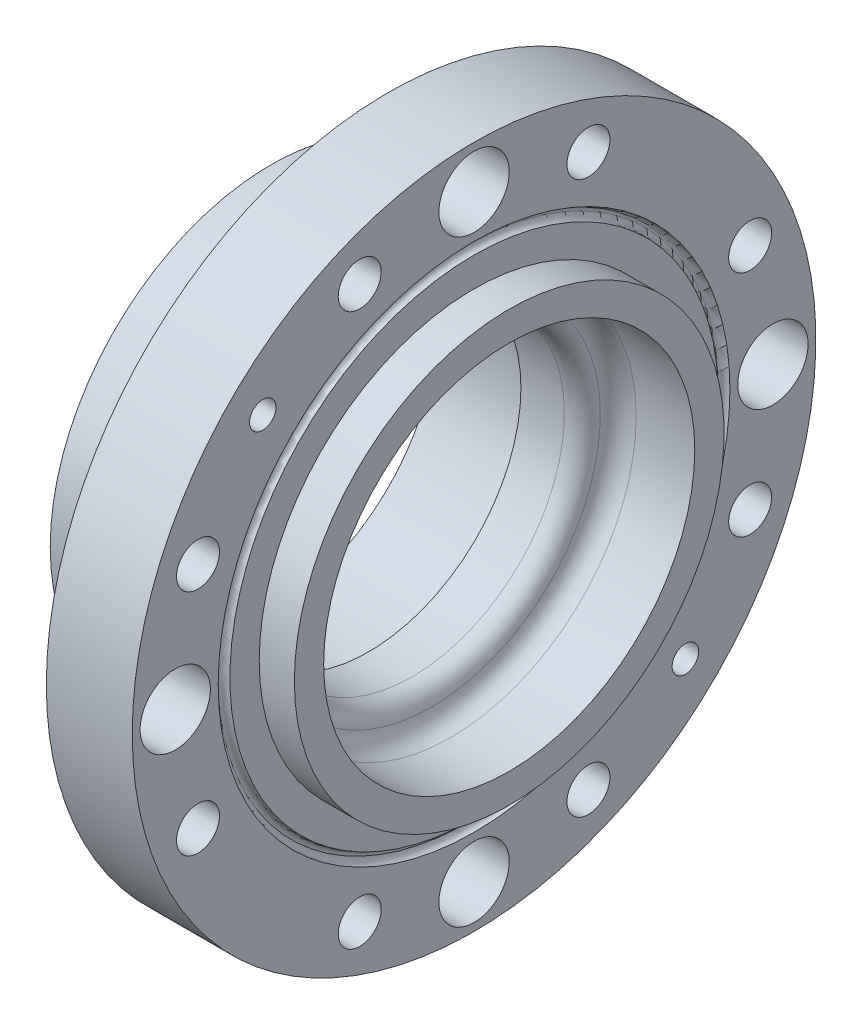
ISO-10303-21;
HEADER;
FILE_DESCRIPTION(('STEP AP214'),'2;1');
FILE_NAME('part.step','',(''),(''),'','','');
FILE_SCHEMA(('AUTOMOTIVE_DESIGN { 1 0 10303 214 1 1 1 1 }'));
ENDSEC;
DATA;
#1=APPLICATION_CONTEXT('core data for automotive mechanical design processes');
#2=APPLICATION_PROTOCOL_DEFINITION('international standard','automotive_design',2000,#1);
#3=PRODUCT_CONTEXT('',#1,'mechanical');
#4=PRODUCT('Part','Part','',(#3));
#5=PRODUCT_RELATED_PRODUCT_CATEGORY('part','',(#4));
#6=PRODUCT_DEFINITION_FORMATION('','',#4);
#7=PRODUCT_DEFINITION_CONTEXT('part definition',#1,'design');
#8=PRODUCT_DEFINITION('design','',#6,#7);
#9=PRODUCT_DEFINITION_SHAPE('','',#8);
#10=(LENGTH_UNIT() NAMED_UNIT(*) SI_UNIT(.MILLI.,.METRE.));
#11=(NAMED_UNIT(*) PLANE_ANGLE_UNIT() SI_UNIT($,.RADIAN.));
#12=(NAMED_UNIT(*) SI_UNIT($,.STERADIAN.) SOLID_ANGLE_UNIT());
#13=UNCERTAINTY_MEASURE_WITH_UNIT(LENGTH_MEASURE(1.E-05),#10,'distance_accuracy_value','');
#14=(GEOMETRIC_REPRESENTATION_CONTEXT(3) GLOBAL_UNCERTAINTY_ASSIGNED_CONTEXT((#13)) GLOBAL_UNIT_ASSIGNED_CONTEXT((#10,
#11,#12)) REPRESENTATION_CONTEXT('',''));
#15=CARTESIAN_POINT('',(0.,0.,0.));
#16=DIRECTION('',(0.,0.,1.));
#17=DIRECTION('',(1.,0.,0.));
#18=AXIS2_PLACEMENT_3D('',#15,#16,#17);
#19=CARTESIAN_POINT('',(5.,0.,0.));
#20=DIRECTION('',(-1.,0.,0.));
#21=DIRECTION('',(0.,0.,1.));
#22=AXIS2_PLACEMENT_3D('',#19,#20,#21);
#23=CYLINDRICAL_SURFACE('',#22,39.);
#24=CARTESIAN_POINT('',(36.1129536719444,0.,0.));
#25=DIRECTION('',(-1.,0.,0.));
#26=DIRECTION('',(0.,-1.,0.));
#27=AXIS2_PLACEMENT_3D('',#24,#25,#26);
#28=CIRCLE('',#27,39.);
#29=CARTESIAN_POINT('',(36.1129536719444,-39.,0.));
#30=VERTEX_POINT('',#29);
#31=EDGE_CURVE('E47',#30,#30,#28,.F.);
#32=ORIENTED_EDGE('',*,*,#31,.T.);
#33=EDGE_LOOP('',(#32));
#34=FACE_BOUND('',#33,.T.);
#35=CARTESIAN_POINT('',(25.,0.,0.));
#36=DIRECTION('',(-1.,0.,0.));
#37=DIRECTION('',(0.,0.,1.));
#38=AXIS2_PLACEMENT_3D('',#35,#36,#37);
#39=CIRCLE('',#38,39.);
#40=CARTESIAN_POINT('',(25.,0.,39.));
#41=VERTEX_POINT('',#40);
#42=EDGE_CURVE('E253',#41,#41,#39,.F.);
#43=ORIENTED_EDGE('',*,*,#42,.F.);
#44=EDGE_LOOP('',(#43));
#45=FACE_BOUND('',#44,.T.);
#46=ADVANCED_FACE('F39',(#34,#45),#23,.F.);
#47=CARTESIAN_POINT('',(51.999813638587,-39.3565741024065,0.));
#48=DIRECTION('',(1.,0.,0.));
#49=DIRECTION('',(0.,0.,-1.));
#50=AXIS2_PLACEMENT_3D('',#47,#48,#49);
#51=PLANE('',#50);
#52=CARTESIAN_POINT('',(51.999813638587,0.,0.));
#53=DIRECTION('',(-1.,0.,0.));
#54=DIRECTION('',(0.,0.,1.));
#55=AXIS2_PLACEMENT_3D('',#52,#53,#54);
#56=CIRCLE('',#55,55.);
#57=CARTESIAN_POINT('',(51.999813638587,0.,55.));
#58=VERTEX_POINT('',#57);
#59=EDGE_CURVE('E236',#58,#58,#56,.T.);
#60=ORIENTED_EDGE('',*,*,#59,.T.);
#61=EDGE_LOOP('',(#60));
#62=FACE_BOUND('',#61,.T.);
#63=CARTESIAN_POINT('',(51.999813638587,0.,0.));
#64=DIRECTION('',(1.,0.,0.));
#65=DIRECTION('',(0.,1.,0.));
#66=AXIS2_PLACEMENT_3D('',#63,#64,#65);
#67=CIRCLE('',#66,62.5);
#68=CARTESIAN_POINT('',(51.999813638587,62.5,0.));
#69=VERTEX_POINT('',#68);
#70=EDGE_CURVE('E252',#69,#69,#67,.T.);
#71=ORIENTED_EDGE('',*,*,#70,.T.);
#72=EDGE_LOOP('',(#71));
#73=FACE_BOUND('',#72,.T.);
#74=ADVANCED_FACE('F273',(#62,#73),#51,.T.);
#75=CARTESIAN_POINT('',(22.0003945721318,0.,0.));
#76=DIRECTION('',(-1.,0.,0.));
#77=DIRECTION('',(0.,0.,1.));
#78=AXIS2_PLACEMENT_3D('',#75,#76,#77);
#79=TOROIDAL_SURFACE('',#78,64.5001456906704,8.00000000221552);
#80=CARTESIAN_POINT('',(30.0003945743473,0.,0.));
#81=DIRECTION('',(-1.,0.,0.));
#82=DIRECTION('',(0.,0.,1.));
#83=AXIS2_PLACEMENT_3D('',#80,#81,#82);
#84=CIRCLE('',#83,64.5001456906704);
#85=CARTESIAN_POINT('',(30.0003945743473,0.,64.5001456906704));
#86=VERTEX_POINT('',#85);
#87=EDGE_CURVE('E227',#86,#86,#84,.T.);
#88=ORIENTED_EDGE('',*,*,#87,.T.);
#89=EDGE_LOOP('',(#88));
#90=FACE_BOUND('',#89,.T.);
#91=CARTESIAN_POINT('',(22.0001938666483,0.,0.));
#92=DIRECTION('',(-1.,0.,0.));
#93=DIRECTION('',(0.,0.,1.));
#94=AXIS2_PLACEMENT_3D('',#91,#92,#93);
#95=CIRCLE('',#94,56.5001456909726);
#96=CARTESIAN_POINT('',(22.0001938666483,0.,56.5001456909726));
#97=VERTEX_POINT('',#96);
#98=EDGE_CURVE('E245',#97,#97,#95,.T.);
#99=ORIENTED_EDGE('',*,*,#98,.F.);
#100=EDGE_LOOP('',(#99));
#101=FACE_BOUND('',#100,.T.);
#102=ADVANCED_FACE('F278',(#90,#101),#79,.F.);
#103=CARTESIAN_POINT('',(0.,0.,0.));
#104=DIRECTION('',(-1.,0.,0.));
#105=DIRECTION('',(0.,0.,1.));
#106=AXIS2_PLACEMENT_3D('',#103,#104,#105);
#107=CYLINDRICAL_SURFACE('',#106,56.5001456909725);
#108=CARTESIAN_POINT('',(0.,0.,0.));
#109=DIRECTION('',(-1.,0.,0.));
#110=DIRECTION('',(0.,0.,1.));
#111=AXIS2_PLACEMENT_3D('',#108,#109,#110);
#112=CIRCLE('',#111,56.5001456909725);
#113=CARTESIAN_POINT('',(0.,0.,56.5001456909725));
#114=VERTEX_POINT('',#113);
#115=EDGE_CURVE('E242',#114,#114,#112,.T.);
#116=ORIENTED_EDGE('',*,*,#115,.F.);
#117=EDGE_LOOP('',(#116));
#118=FACE_BOUND('',#117,.T.);
#119=ORIENTED_EDGE('',*,*,#98,.T.);
#120=EDGE_LOOP('',(#119));
#121=FACE_BOUND('',#120,.T.);
#122=ADVANCED_FACE('F434',(#118,#121),#107,.T.);
#123=CARTESIAN_POINT('',(0.,-39.3565741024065,0.));
#124=DIRECTION('',(1.,0.,0.));
#125=DIRECTION('',(0.,0.,-1.));
#126=AXIS2_PLACEMENT_3D('',#123,#124,#125);
#127=PLANE('',#126);
#128=CARTESIAN_POINT('',(0.,0.,0.));
#129=DIRECTION('',(-1.,0.,0.));
#130=DIRECTION('',(0.,0.,1.));
#131=AXIS2_PLACEMENT_3D('',#128,#129,#130);
#132=CIRCLE('',#131,42.5);
#133=CARTESIAN_POINT('',(0.,0.,42.5));
#134=VERTEX_POINT('',#133);
#135=EDGE_CURVE('E466',#134,#134,#132,.T.);
#136=ORIENTED_EDGE('',*,*,#135,.F.);
#137=EDGE_LOOP('',(#136));
#138=FACE_BOUND('',#137,.T.);
#139=CARTESIAN_POINT('',(0.,34.294678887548,34.2946788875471));
#140=DIRECTION('',(-1.,0.,0.));
#141=DIRECTION('',(0.,0.,1.));
#142=AXIS2_PLACEMENT_3D('',#139,#140,#141);
#143=CIRCLE('',#142,2.49999999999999);
#144=CARTESIAN_POINT('',(0.,34.294678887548,36.7946788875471));
#145=VERTEX_POINT('',#144);
#146=EDGE_CURVE('E83',#145,#145,#143,.T.);
#147=ORIENTED_EDGE('',*,*,#146,.F.);
#148=EDGE_LOOP('',(#147));
#149=FACE_BOUND('',#148,.T.);
#150=CARTESIAN_POINT('',(0.,5.08010534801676E-13,48.5));
#151=DIRECTION('',(-1.,0.,0.));
#152=DIRECTION('',(0.,0.,1.));
#153=AXIS2_PLACEMENT_3D('',#150,#151,#152);
#154=CIRCLE('',#153,2.49999999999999);
#155=CARTESIAN_POINT('',(0.,5.08010534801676E-13,51.));
#156=VERTEX_POINT('',#155);
#157=EDGE_CURVE('E82',#156,#156,#154,.T.);
#158=ORIENTED_EDGE('',*,*,#157,.F.);
#159=EDGE_LOOP('',(#158));
#160=FACE_BOUND('',#159,.T.);
#161=CARTESIAN_POINT('',(0.,-34.2946788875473,34.2946788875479));
#162=DIRECTION('',(-1.,0.,0.));
#163=DIRECTION('',(0.,0.,1.));
#164=AXIS2_PLACEMENT_3D('',#161,#162,#163);
#165=CIRCLE('',#164,2.49999999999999);
#166=CARTESIAN_POINT('',(0.,-34.2946788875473,36.7946788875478));
#167=VERTEX_POINT('',#166);
#168=EDGE_CURVE('E95',#167,#167,#165,.T.);
#169=ORIENTED_EDGE('',*,*,#168,.F.);
#170=EDGE_LOOP('',(#169));
#171=FACE_BOUND('',#170,.T.);
#172=CARTESIAN_POINT('',(0.,-48.5,3.38673689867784E-13));
#173=DIRECTION('',(-1.,0.,0.));
#174=DIRECTION('',(0.,0.,1.));
#175=AXIS2_PLACEMENT_3D('',#172,#173,#174);
#176=CIRCLE('',#175,2.49999999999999);
#177=CARTESIAN_POINT('',(0.,-48.5,2.50000000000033));
#178=VERTEX_POINT('',#177);
#179=EDGE_CURVE('E101',#178,#178,#176,.T.);
#180=ORIENTED_EDGE('',*,*,#179,.F.);
#181=EDGE_LOOP('',(#180));
#182=FACE_BOUND('',#181,.T.);
#183=CARTESIAN_POINT('',(0.,-34.2946788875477,-34.2946788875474));
#184=DIRECTION('',(-1.,0.,0.));
#185=DIRECTION('',(0.,0.,1.));
#186=AXIS2_PLACEMENT_3D('',#183,#184,#185);
#187=CIRCLE('',#186,2.49999999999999);
#188=CARTESIAN_POINT('',(0.,-34.2946788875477,-31.7946788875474));
#189=VERTEX_POINT('',#188);
#190=EDGE_CURVE('E107',#189,#189,#187,.T.);
#191=ORIENTED_EDGE('',*,*,#190,.F.);
#192=EDGE_LOOP('',(#191));
#193=FACE_BOUND('',#192,.T.);
#194=CARTESIAN_POINT('',(0.,-1.69336844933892E-13,-48.5));
#195=DIRECTION('',(-1.,0.,0.));
#196=DIRECTION('',(0.,0.,1.));
#197=AXIS2_PLACEMENT_3D('',#194,#195,#196);
#198=CIRCLE('',#197,2.49999999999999);
#199=CARTESIAN_POINT('',(0.,-1.69336844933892E-13,-46.));
#200=VERTEX_POINT('',#199);
#201=EDGE_CURVE('E113',#200,#200,#198,.T.);
#202=ORIENTED_EDGE('',*,*,#201,.F.);
#203=EDGE_LOOP('',(#202));
#204=FACE_BOUND('',#203,.T.);
#205=CARTESIAN_POINT('',(0.,34.2946788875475,-34.2946788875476));
#206=DIRECTION('',(-1.,0.,0.));
#207=DIRECTION('',(0.,0.,1.));
#208=AXIS2_PLACEMENT_3D('',#205,#206,#207);
#209=CIRCLE('',#208,2.49999999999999);
#210=CARTESIAN_POINT('',(0.,34.2946788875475,-31.7946788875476));
#211=VERTEX_POINT('',#210);
#212=EDGE_CURVE('E119',#211,#211,#209,.T.);
#213=ORIENTED_EDGE('',*,*,#212,.F.);
#214=EDGE_LOOP('',(#213));
#215=FACE_BOUND('',#214,.T.);
#216=CARTESIAN_POINT('',(0.,48.5,0.));
#217=DIRECTION('',(-1.,0.,0.));
#218=DIRECTION('',(0.,0.,1.));
#219=AXIS2_PLACEMENT_3D('',#216,#217,#218);
#220=CIRCLE('',#219,2.49999999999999);
#221=CARTESIAN_POINT('',(0.,48.5,2.49999999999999));
#222=VERTEX_POINT('',#221);
#223=EDGE_CURVE('E125',#222,#222,#220,.T.);
#224=ORIENTED_EDGE('',*,*,#223,.F.);
#225=EDGE_LOOP('',(#224));
#226=FACE_BOUND('',#225,.T.);
#227=ORIENTED_EDGE('',*,*,#115,.T.);
#228=EDGE_LOOP('',(#227));
#229=FACE_BOUND('',#228,.T.);
#230=ADVANCED_FACE('F430',(#138,#149,#160,#171,#182,#193,#204,#215,#226,#229),#127,.F.);
#231=CARTESIAN_POINT('',(60.999813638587,-39.3565741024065,0.));
#232=DIRECTION('',(-1.,0.,0.));
#233=DIRECTION('',(0.,0.,1.));
#234=AXIS2_PLACEMENT_3D('',#231,#232,#233);
#235=PLANE('',#234);
#236=CARTESIAN_POINT('',(60.999813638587,0.,0.));
#237=DIRECTION('',(1.,0.,0.));
#238=DIRECTION('',(0.,1.,0.));
#239=AXIS2_PLACEMENT_3D('',#236,#237,#238);
#240=CIRCLE('',#239,47.5);
#241=CARTESIAN_POINT('',(60.999813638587,47.5,0.));
#242=VERTEX_POINT('',#241);
#243=EDGE_CURVE('E89',#242,#242,#240,.T.);
#244=ORIENTED_EDGE('',*,*,#243,.F.);
#245=EDGE_LOOP('',(#244));
#246=FACE_BOUND('',#245,.T.);
#247=CARTESIAN_POINT('',(60.999813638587,0.,0.));
#248=DIRECTION('',(-1.,0.,0.));
#249=DIRECTION('',(0.,0.,1.));
#250=AXIS2_PLACEMENT_3D('',#247,#248,#249);
#251=CIRCLE('',#250,55.);
#252=CARTESIAN_POINT('',(60.999813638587,0.,55.));
#253=VERTEX_POINT('',#252);
#254=EDGE_CURVE('E239',#253,#253,#251,.T.);
#255=ORIENTED_EDGE('',*,*,#254,.F.);
#256=EDGE_LOOP('',(#255));
#257=FACE_BOUND('',#256,.T.);
#258=ADVANCED_FACE('F426',(#246,#257),#235,.F.);
#259=CARTESIAN_POINT('',(0.,0.,0.));
#260=DIRECTION('',(-1.,0.,0.));
#261=DIRECTION('',(0.,0.,1.));
#262=AXIS2_PLACEMENT_3D('',#259,#260,#261);
#263=CYLINDRICAL_SURFACE('',#262,55.);
#264=ORIENTED_EDGE('',*,*,#59,.F.);
#265=EDGE_LOOP('',(#264));
#266=FACE_BOUND('',#265,.T.);
#267=ORIENTED_EDGE('',*,*,#254,.T.);
#268=EDGE_LOOP('',(#267));
#269=FACE_BOUND('',#268,.T.);
#270=ADVANCED_FACE('F422',(#266,#269),#263,.T.);
#271=CARTESIAN_POINT('',(51.999813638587,0.,0.));
#272=DIRECTION('',(1.,0.,0.));
#273=DIRECTION('',(0.,1.,0.));
#274=AXIS2_PLACEMENT_3D('',#271,#272,#273);
#275=CIRCLE('',#274,65.5);
#276=CARTESIAN_POINT('',(51.999813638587,65.5,0.));
#277=VERTEX_POINT('',#276);
#278=EDGE_CURVE('E457',#277,#277,#275,.T.);
#279=ORIENTED_EDGE('',*,*,#278,.F.);
#280=EDGE_LOOP('',(#279));
#281=FACE_BOUND('',#280,.T.);
#282=CARTESIAN_POINT('',(51.999813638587,-54.0936687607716,-54.0936687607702));
#283=DIRECTION('',(1.,0.,0.));
#284=DIRECTION('',(0.,0.,-1.));
#285=AXIS2_PLACEMENT_3D('',#282,#283,#284);
#286=CIRCLE('',#285,3.39999999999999);
#287=CARTESIAN_POINT('',(51.999813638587,-54.0936687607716,-57.4936687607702));
#288=VERTEX_POINT('',#287);
#289=EDGE_CURVE('E134',#288,#288,#286,.T.);
#290=ORIENTED_EDGE('',*,*,#289,.F.);
#291=EDGE_LOOP('',(#290));
#292=FACE_BOUND('',#291,.T.);
#293=CARTESIAN_POINT('',(51.999813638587,54.0936687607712,54.0936687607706));
#294=DIRECTION('',(1.,0.,0.));
#295=DIRECTION('',(0.,0.,-1.));
#296=AXIS2_PLACEMENT_3D('',#293,#294,#295);
#297=CIRCLE('',#296,3.39999999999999);
#298=CARTESIAN_POINT('',(51.999813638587,54.0936687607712,50.6936687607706));
#299=VERTEX_POINT('',#298);
#300=EDGE_CURVE('E146',#299,#299,#297,.T.);
#301=ORIENTED_EDGE('',*,*,#300,.F.);
#302=EDGE_LOOP('',(#301));
#303=FACE_BOUND('',#302,.T.);
#304=CARTESIAN_POINT('',(51.999813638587,8.01295431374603E-13,-76.5));
#305=DIRECTION('',(1.,0.,0.));
#306=DIRECTION('',(0.,0.,-1.));
#307=AXIS2_PLACEMENT_3D('',#304,#305,#306);
#308=CIRCLE('',#307,9.);
#309=CARTESIAN_POINT('',(51.999813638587,8.01295431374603E-13,-85.5));
#310=VERTEX_POINT('',#309);
#311=EDGE_CURVE('E158',#310,#310,#308,.T.);
#312=ORIENTED_EDGE('',*,*,#311,.F.);
#313=EDGE_LOOP('',(#312));
#314=FACE_BOUND('',#313,.T.);
#315=CARTESIAN_POINT('',(51.999813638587,-76.5,-5.34196954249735E-13));
#316=DIRECTION('',(1.,0.,0.));
#317=DIRECTION('',(0.,0.,-1.));
#318=AXIS2_PLACEMENT_3D('',#315,#316,#317);
#319=CIRCLE('',#318,9.);
#320=CARTESIAN_POINT('',(51.999813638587,-76.5,-9.00000000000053));
#321=VERTEX_POINT('',#320);
#322=EDGE_CURVE('E164',#321,#321,#319,.T.);
#323=ORIENTED_EDGE('',*,*,#322,.F.);
#324=EDGE_LOOP('',(#323));
#325=FACE_BOUND('',#324,.T.);
#326=CARTESIAN_POINT('',(51.999813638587,-2.67098477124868E-13,76.5));
#327=DIRECTION('',(1.,0.,0.));
#328=DIRECTION('',(0.,0.,-1.));
#329=AXIS2_PLACEMENT_3D('',#326,#327,#328);
#330=CIRCLE('',#329,9.);
#331=CARTESIAN_POINT('',(51.999813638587,-2.67098477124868E-13,67.5));
#332=VERTEX_POINT('',#331);
#333=EDGE_CURVE('E170',#332,#332,#330,.T.);
#334=ORIENTED_EDGE('',*,*,#333,.F.);
#335=EDGE_LOOP('',(#334));
#336=FACE_BOUND('',#335,.T.);
#337=CARTESIAN_POINT('',(51.999813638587,76.5,0.));
#338=DIRECTION('',(1.,0.,0.));
#339=DIRECTION('',(0.,0.,-1.));
#340=AXIS2_PLACEMENT_3D('',#337,#338,#339);
#341=CIRCLE('',#340,9.);
#342=CARTESIAN_POINT('',(51.999813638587,76.5,-9.));
#343=VERTEX_POINT('',#342);
#344=EDGE_CURVE('E176',#343,#343,#341,.T.);
#345=ORIENTED_EDGE('',*,*,#344,.F.);
#346=EDGE_LOOP('',(#345));
#347=FACE_BOUND('',#346,.T.);
#348=CARTESIAN_POINT('',(51.999813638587,-29.275575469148,70.6774913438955));
#349=DIRECTION('',(1.,0.,0.));
#350=DIRECTION('',(0.,0.,-1.));
#351=AXIS2_PLACEMENT_3D('',#348,#349,#350);
#352=CIRCLE('',#351,5.49999999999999);
#353=CARTESIAN_POINT('',(51.999813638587,-29.275575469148,65.1774913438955));
#354=VERTEX_POINT('',#353);
#355=EDGE_CURVE('E182',#354,#354,#352,.T.);
#356=ORIENTED_EDGE('',*,*,#355,.F.);
#357=EDGE_LOOP('',(#356));
#358=FACE_BOUND('',#357,.T.);
#359=CARTESIAN_POINT('',(51.999813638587,29.2752825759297,70.6767842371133));
#360=DIRECTION('',(1.,0.,0.));
#361=DIRECTION('',(0.,0.,-1.));
#362=AXIS2_PLACEMENT_3D('',#359,#360,#361);
#363=CIRCLE('',#362,5.5);
#364=CARTESIAN_POINT('',(51.999813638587,29.2752825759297,65.1767842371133));
#365=VERTEX_POINT('',#364);
#366=EDGE_CURVE('E188',#365,#365,#363,.T.);
#367=ORIENTED_EDGE('',*,*,#366,.F.);
#368=EDGE_LOOP('',(#367));
#369=FACE_BOUND('',#368,.T.);
#370=CARTESIAN_POINT('',(51.999813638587,-70.6774913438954,-29.2755754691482));
#371=DIRECTION('',(1.,0.,0.));
#372=DIRECTION('',(0.,0.,-1.));
#373=AXIS2_PLACEMENT_3D('',#370,#371,#372);
#374=CIRCLE('',#373,5.49999999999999);
#375=CARTESIAN_POINT('',(51.999813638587,-70.6774913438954,-34.7755754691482));
#376=VERTEX_POINT('',#375);
#377=EDGE_CURVE('E194',#376,#376,#374,.T.);
#378=ORIENTED_EDGE('',*,*,#377,.F.);
#379=EDGE_LOOP('',(#378));
#380=FACE_BOUND('',#379,.T.);
#381=CARTESIAN_POINT('',(51.999813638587,-70.6767842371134,29.2752825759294));
#382=DIRECTION('',(1.,0.,0.));
#383=DIRECTION('',(0.,0.,-1.));
#384=AXIS2_PLACEMENT_3D('',#381,#382,#383);
#385=CIRCLE('',#384,5.5);
#386=CARTESIAN_POINT('',(51.999813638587,-70.6767842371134,23.7752825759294));
#387=VERTEX_POINT('',#386);
#388=EDGE_CURVE('E200',#387,#387,#385,.T.);
#389=ORIENTED_EDGE('',*,*,#388,.F.);
#390=EDGE_LOOP('',(#389));
#391=FACE_BOUND('',#390,.T.);
#392=CARTESIAN_POINT('',(51.999813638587,29.2755754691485,-70.6774913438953));
#393=DIRECTION('',(1.,0.,0.));
#394=DIRECTION('',(0.,0.,-1.));
#395=AXIS2_PLACEMENT_3D('',#392,#393,#394);
#396=CIRCLE('',#395,5.49999999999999);
#397=CARTESIAN_POINT('',(51.999813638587,29.2755754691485,-76.1774913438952));
#398=VERTEX_POINT('',#397);
#399=EDGE_CURVE('E206',#398,#398,#396,.T.);
#400=ORIENTED_EDGE('',*,*,#399,.F.);
#401=EDGE_LOOP('',(#400));
#402=FACE_BOUND('',#401,.T.);
#403=CARTESIAN_POINT('',(51.999813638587,-29.2752825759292,-70.6767842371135));
#404=DIRECTION('',(1.,0.,0.));
#405=DIRECTION('',(0.,0.,-1.));
#406=AXIS2_PLACEMENT_3D('',#403,#404,#405);
#407=CIRCLE('',#406,5.5);
#408=CARTESIAN_POINT('',(51.999813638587,-29.2752825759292,-76.1767842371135));
#409=VERTEX_POINT('',#408);
#410=EDGE_CURVE('E212',#409,#409,#407,.T.);
#411=ORIENTED_EDGE('',*,*,#410,.F.);
#412=EDGE_LOOP('',(#411));
#413=FACE_BOUND('',#412,.T.);
#414=CARTESIAN_POINT('',(51.999813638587,70.6774913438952,29.2755754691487));
#415=DIRECTION('',(1.,0.,0.));
#416=DIRECTION('',(0.,0.,-1.));
#417=AXIS2_PLACEMENT_3D('',#414,#415,#416);
#418=CIRCLE('',#417,5.49999999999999);
#419=CARTESIAN_POINT('',(51.999813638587,70.6774913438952,23.7755754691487));
#420=VERTEX_POINT('',#419);
#421=EDGE_CURVE('E218',#420,#420,#418,.T.);
#422=ORIENTED_EDGE('',*,*,#421,.F.);
#423=EDGE_LOOP('',(#422));
#424=FACE_BOUND('',#423,.T.);
#425=CARTESIAN_POINT('',(51.999813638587,70.6767842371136,-29.2752825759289));
#426=DIRECTION('',(1.,0.,0.));
#427=DIRECTION('',(0.,0.,-1.));
#428=AXIS2_PLACEMENT_3D('',#425,#426,#427);
#429=CIRCLE('',#428,5.5);
#430=CARTESIAN_POINT('',(51.999813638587,70.6767842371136,-34.7752825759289));
#431=VERTEX_POINT('',#430);
#432=EDGE_CURVE('E224',#431,#431,#429,.T.);
#433=ORIENTED_EDGE('',*,*,#432,.F.);
#434=EDGE_LOOP('',(#433));
#435=FACE_BOUND('',#434,.T.);
#436=CARTESIAN_POINT('',(51.999813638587,0.,0.));
#437=DIRECTION('',(-1.,0.,0.));
#438=DIRECTION('',(0.,0.,1.));
#439=AXIS2_PLACEMENT_3D('',#436,#437,#438);
#440=CIRCLE('',#439,87.4997413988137);
#441=CARTESIAN_POINT('',(51.999813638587,0.,87.4997413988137));
#442=VERTEX_POINT('',#441);
#443=EDGE_CURVE('E233',#442,#442,#440,.T.);
#444=ORIENTED_EDGE('',*,*,#443,.F.);
#445=EDGE_LOOP('',(#444));
#446=FACE_BOUND('',#445,.T.);
#447=ADVANCED_FACE('F281',(#281,#292,#303,#314,#325,#336,#347,#358,#369,#380,#391,#402,#413,
#424,#435,#446),#51,.T.);
#448=CARTESIAN_POINT('',(0.,0.,0.));
#449=DIRECTION('',(-1.,0.,0.));
#450=DIRECTION('',(0.,0.,1.));
#451=AXIS2_PLACEMENT_3D('',#448,#449,#450);
#452=CYLINDRICAL_SURFACE('',#451,87.4997413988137);
#453=CARTESIAN_POINT('',(30.0003945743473,0.,0.));
#454=DIRECTION('',(-1.,0.,0.));
#455=DIRECTION('',(0.,0.,1.));
#456=AXIS2_PLACEMENT_3D('',#453,#454,#455);
#457=CIRCLE('',#456,87.4997413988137);
#458=CARTESIAN_POINT('',(30.0003945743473,0.,87.4997413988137));
#459=VERTEX_POINT('',#458);
#460=EDGE_CURVE('E230',#459,#459,#457,.T.);
#461=ORIENTED_EDGE('',*,*,#460,.F.);
#462=EDGE_LOOP('',(#461));
#463=FACE_BOUND('',#462,.T.);
#464=ORIENTED_EDGE('',*,*,#443,.T.);
#465=EDGE_LOOP('',(#464));
#466=FACE_BOUND('',#465,.T.);
#467=ADVANCED_FACE('F416',(#463,#466),#452,.T.);
#468=CARTESIAN_POINT('',(30.0003945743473,-39.3565741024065,0.));
#469=DIRECTION('',(1.,0.,0.));
#470=DIRECTION('',(0.,0.,-1.));
#471=AXIS2_PLACEMENT_3D('',#468,#469,#470);
#472=PLANE('',#471);
#473=CARTESIAN_POINT('',(30.0003945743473,-54.0936687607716,-54.0936687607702));
#474=DIRECTION('',(-1.,0.,0.));
#475=DIRECTION('',(0.,0.,-1.));
#476=AXIS2_PLACEMENT_3D('',#473,#474,#475);
#477=CIRCLE('',#476,7.5);
#478=CARTESIAN_POINT('',(30.0003945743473,-54.0936687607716,-61.5936687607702));
#479=VERTEX_POINT('',#478);
#480=EDGE_CURVE('E137',#479,#479,#477,.T.);
#481=ORIENTED_EDGE('',*,*,#480,.F.);
#482=EDGE_LOOP('',(#481));
#483=FACE_BOUND('',#482,.T.);
#484=CARTESIAN_POINT('',(30.0003945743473,54.0936687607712,54.0936687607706));
#485=DIRECTION('',(-1.,0.,0.));
#486=DIRECTION('',(0.,0.,1.));
#487=AXIS2_PLACEMENT_3D('',#484,#485,#486);
#488=CIRCLE('',#487,7.5);
#489=CARTESIAN_POINT('',(30.0003945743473,54.0936687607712,61.5936687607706));
#490=VERTEX_POINT('',#489);
#491=EDGE_CURVE('E149',#490,#490,#488,.T.);
#492=ORIENTED_EDGE('',*,*,#491,.F.);
#493=EDGE_LOOP('',(#492));
#494=FACE_BOUND('',#493,.T.);
#495=CARTESIAN_POINT('',(30.0003945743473,8.01295431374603E-13,-76.5));
#496=DIRECTION('',(-1.,0.,0.));
#497=DIRECTION('',(0.,0.,1.));
#498=AXIS2_PLACEMENT_3D('',#495,#496,#497);
#499=CIRCLE('',#498,9.);
#500=CARTESIAN_POINT('',(30.0003945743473,8.01295431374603E-13,-67.5));
#501=VERTEX_POINT('',#500);
#502=EDGE_CURVE('E153',#501,#501,#499,.T.);
#503=ORIENTED_EDGE('',*,*,#502,.F.);
#504=EDGE_LOOP('',(#503));
#505=FACE_BOUND('',#504,.T.);
#506=CARTESIAN_POINT('',(30.0003945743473,-76.5,-5.34196954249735E-13));
#507=DIRECTION('',(-1.,0.,0.));
#508=DIRECTION('',(0.,0.,1.));
#509=AXIS2_PLACEMENT_3D('',#506,#507,#508);
#510=CIRCLE('',#509,9.);
#511=CARTESIAN_POINT('',(30.0003945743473,-76.5,8.99999999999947));
#512=VERTEX_POINT('',#511);
#513=EDGE_CURVE('E161',#512,#512,#510,.T.);
#514=ORIENTED_EDGE('',*,*,#513,.F.);
#515=EDGE_LOOP('',(#514));
#516=FACE_BOUND('',#515,.T.);
#517=CARTESIAN_POINT('',(30.0003945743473,-2.67098477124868E-13,76.5));
#518=DIRECTION('',(-1.,0.,0.));
#519=DIRECTION('',(0.,0.,1.));
#520=AXIS2_PLACEMENT_3D('',#517,#518,#519);
#521=CIRCLE('',#520,9.);
#522=CARTESIAN_POINT('',(30.0003945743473,-2.67098477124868E-13,85.5));
#523=VERTEX_POINT('',#522);
#524=EDGE_CURVE('E167',#523,#523,#521,.T.);
#525=ORIENTED_EDGE('',*,*,#524,.F.);
#526=EDGE_LOOP('',(#525));
#527=FACE_BOUND('',#526,.T.);
#528=CARTESIAN_POINT('',(30.0003945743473,76.5,0.));
#529=DIRECTION('',(-1.,0.,0.));
#530=DIRECTION('',(0.,0.,1.));
#531=AXIS2_PLACEMENT_3D('',#528,#529,#530);
#532=CIRCLE('',#531,9.);
#533=CARTESIAN_POINT('',(30.0003945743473,76.5,9.));
#534=VERTEX_POINT('',#533);
#535=EDGE_CURVE('E173',#534,#534,#532,.T.);
#536=ORIENTED_EDGE('',*,*,#535,.F.);
#537=EDGE_LOOP('',(#536));
#538=FACE_BOUND('',#537,.T.);
#539=CARTESIAN_POINT('',(30.0003945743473,-29.275575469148,70.6774913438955));
#540=DIRECTION('',(-1.,0.,0.));
#541=DIRECTION('',(0.,-1.,0.));
#542=AXIS2_PLACEMENT_3D('',#539,#540,#541);
#543=CIRCLE('',#542,5.49999999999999);
#544=CARTESIAN_POINT('',(30.0003945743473,-34.775575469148,70.6774913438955));
#545=VERTEX_POINT('',#544);
#546=EDGE_CURVE('E179',#545,#545,#543,.T.);
#547=ORIENTED_EDGE('',*,*,#546,.F.);
#548=EDGE_LOOP('',(#547));
#549=FACE_BOUND('',#548,.T.);
#550=CARTESIAN_POINT('',(30.0003945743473,29.2752825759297,70.6767842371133));
#551=DIRECTION('',(-1.,0.,0.));
#552=DIRECTION('',(0.,-1.,0.));
#553=AXIS2_PLACEMENT_3D('',#550,#551,#552);
#554=CIRCLE('',#553,5.5);
#555=CARTESIAN_POINT('',(30.0003945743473,23.7752825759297,70.6767842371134));
#556=VERTEX_POINT('',#555);
#557=EDGE_CURVE('E185',#556,#556,#554,.T.);
#558=ORIENTED_EDGE('',*,*,#557,.F.);
#559=EDGE_LOOP('',(#558));
#560=FACE_BOUND('',#559,.T.);
#561=CARTESIAN_POINT('',(30.0003945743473,-70.6774913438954,-29.2755754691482));
#562=DIRECTION('',(-1.,0.,0.));
#563=DIRECTION('',(0.,0.,-1.));
#564=AXIS2_PLACEMENT_3D('',#561,#562,#563);
#565=CIRCLE('',#564,5.49999999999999);
#566=CARTESIAN_POINT('',(30.0003945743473,-70.6774913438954,-34.7755754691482));
#567=VERTEX_POINT('',#566);
#568=EDGE_CURVE('E191',#567,#567,#565,.T.);
#569=ORIENTED_EDGE('',*,*,#568,.F.);
#570=EDGE_LOOP('',(#569));
#571=FACE_BOUND('',#570,.T.);
#572=CARTESIAN_POINT('',(30.0003945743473,-70.6767842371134,29.2752825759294));
#573=DIRECTION('',(-1.,0.,0.));
#574=DIRECTION('',(0.,0.,-1.));
#575=AXIS2_PLACEMENT_3D('',#572,#573,#574);
#576=CIRCLE('',#575,5.5);
#577=CARTESIAN_POINT('',(30.0003945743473,-70.6767842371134,23.7752825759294));
#578=VERTEX_POINT('',#577);
#579=EDGE_CURVE('E197',#578,#578,#576,.T.);
#580=ORIENTED_EDGE('',*,*,#579,.F.);
#581=EDGE_LOOP('',(#580));
#582=FACE_BOUND('',#581,.T.);
#583=CARTESIAN_POINT('',(30.0003945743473,29.2755754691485,-70.6774913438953));
#584=DIRECTION('',(-1.,0.,0.));
#585=DIRECTION('',(0.,1.,0.));
#586=AXIS2_PLACEMENT_3D('',#583,#584,#585);
#587=CIRCLE('',#586,5.49999999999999);
#588=CARTESIAN_POINT('',(30.0003945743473,34.7755754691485,-70.6774913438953));
#589=VERTEX_POINT('',#588);
#590=EDGE_CURVE('E203',#589,#589,#587,.T.);
#591=ORIENTED_EDGE('',*,*,#590,.F.);
#592=EDGE_LOOP('',(#591));
#593=FACE_BOUND('',#592,.T.);
#594=CARTESIAN_POINT('',(30.0003945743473,-29.2752825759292,-70.6767842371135));
#595=DIRECTION('',(-1.,0.,0.));
#596=DIRECTION('',(0.,1.,0.));
#597=AXIS2_PLACEMENT_3D('',#594,#595,#596);
#598=CIRCLE('',#597,5.5);
#599=CARTESIAN_POINT('',(30.0003945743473,-23.7752825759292,-70.6767842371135));
#600=VERTEX_POINT('',#599);
#601=EDGE_CURVE('E209',#600,#600,#598,.T.);
#602=ORIENTED_EDGE('',*,*,#601,.F.);
#603=EDGE_LOOP('',(#602));
#604=FACE_BOUND('',#603,.T.);
#605=CARTESIAN_POINT('',(30.0003945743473,70.6774913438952,29.2755754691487));
#606=DIRECTION('',(-1.,0.,0.));
#607=DIRECTION('',(0.,0.,1.));
#608=AXIS2_PLACEMENT_3D('',#605,#606,#607);
#609=CIRCLE('',#608,5.49999999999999);
#610=CARTESIAN_POINT('',(30.0003945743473,70.6774913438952,34.7755754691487));
#611=VERTEX_POINT('',#610);
#612=EDGE_CURVE('E215',#611,#611,#609,.T.);
#613=ORIENTED_EDGE('',*,*,#612,.F.);
#614=EDGE_LOOP('',(#613));
#615=FACE_BOUND('',#614,.T.);
#616=CARTESIAN_POINT('',(30.0003945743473,70.6767842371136,-29.2752825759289));
#617=DIRECTION('',(-1.,0.,0.));
#618=DIRECTION('',(0.,0.,1.));
#619=AXIS2_PLACEMENT_3D('',#616,#617,#618);
#620=CIRCLE('',#619,5.5);
#621=CARTESIAN_POINT('',(30.0003945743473,70.6767842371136,-23.7752825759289));
#622=VERTEX_POINT('',#621);
#623=EDGE_CURVE('E221',#622,#622,#620,.T.);
#624=ORIENTED_EDGE('',*,*,#623,.F.);
#625=EDGE_LOOP('',(#624));
#626=FACE_BOUND('',#625,.T.);
#627=ORIENTED_EDGE('',*,*,#87,.F.);
#628=EDGE_LOOP('',(#627));
#629=FACE_BOUND('',#628,.T.);
#630=ORIENTED_EDGE('',*,*,#460,.T.);
#631=EDGE_LOOP('',(#630));
#632=FACE_BOUND('',#631,.T.);
#633=ADVANCED_FACE('F412',(#483,#494,#505,#516,#527,#538,#549,#560,#571,#582,#593,#604,#615,
#626,#629,#632),#472,.F.);
#634=CARTESIAN_POINT('',(58.0003945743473,70.6767842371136,-29.2752825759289));
#635=DIRECTION('',(-1.,0.,0.));
#636=DIRECTION('',(0.,0.,1.));
#637=AXIS2_PLACEMENT_3D('',#634,#635,#636);
#638=CYLINDRICAL_SURFACE('',#637,5.5);
#639=ORIENTED_EDGE('',*,*,#432,.T.);
#640=EDGE_LOOP('',(#639));
#641=FACE_BOUND('',#640,.T.);
#642=ORIENTED_EDGE('',*,*,#623,.T.);
#643=EDGE_LOOP('',(#642));
#644=FACE_BOUND('',#643,.T.);
#645=ADVANCED_FACE('F408',(#641,#644),#638,.F.);
#646=CARTESIAN_POINT('',(58.0003945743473,70.6774913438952,29.2755754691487));
#647=DIRECTION('',(-1.,0.,0.));
#648=DIRECTION('',(0.,0.,1.));
#649=AXIS2_PLACEMENT_3D('',#646,#647,#648);
#650=CYLINDRICAL_SURFACE('',#649,5.49999999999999);
#651=ORIENTED_EDGE('',*,*,#421,.T.);
#652=EDGE_LOOP('',(#651));
#653=FACE_BOUND('',#652,.T.);
#654=ORIENTED_EDGE('',*,*,#612,.T.);
#655=EDGE_LOOP('',(#654));
#656=FACE_BOUND('',#655,.T.);
#657=ADVANCED_FACE('F404',(#653,#656),#650,.F.);
#658=CARTESIAN_POINT('',(58.0003945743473,-29.2752825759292,-70.6767842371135));
#659=DIRECTION('',(-1.,0.,0.));
#660=DIRECTION('',(0.,0.,1.));
#661=AXIS2_PLACEMENT_3D('',#658,#659,#660);
#662=CYLINDRICAL_SURFACE('',#661,5.5);
#663=ORIENTED_EDGE('',*,*,#410,.T.);
#664=EDGE_LOOP('',(#663));
#665=FACE_BOUND('',#664,.T.);
#666=ORIENTED_EDGE('',*,*,#601,.T.);
#667=EDGE_LOOP('',(#666));
#668=FACE_BOUND('',#667,.T.);
#669=ADVANCED_FACE('F400',(#665,#668),#662,.F.);
#670=CARTESIAN_POINT('',(58.0003945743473,29.2755754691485,-70.6774913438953));
#671=DIRECTION('',(-1.,0.,0.));
#672=DIRECTION('',(0.,0.,1.));
#673=AXIS2_PLACEMENT_3D('',#670,#671,#672);
#674=CYLINDRICAL_SURFACE('',#673,5.49999999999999);
#675=ORIENTED_EDGE('',*,*,#399,.T.);
#676=EDGE_LOOP('',(#675));
#677=FACE_BOUND('',#676,.T.);
#678=ORIENTED_EDGE('',*,*,#590,.T.);
#679=EDGE_LOOP('',(#678));
#680=FACE_BOUND('',#679,.T.);
#681=ADVANCED_FACE('F396',(#677,#680),#674,.F.);
#682=CARTESIAN_POINT('',(58.0003945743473,-70.6767842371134,29.2752825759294));
#683=DIRECTION('',(-1.,0.,0.));
#684=DIRECTION('',(0.,0.,1.));
#685=AXIS2_PLACEMENT_3D('',#682,#683,#684);
#686=CYLINDRICAL_SURFACE('',#685,5.5);
#687=ORIENTED_EDGE('',*,*,#388,.T.);
#688=EDGE_LOOP('',(#687));
#689=FACE_BOUND('',#688,.T.);
#690=ORIENTED_EDGE('',*,*,#579,.T.);
#691=EDGE_LOOP('',(#690));
#692=FACE_BOUND('',#691,.T.);
#693=ADVANCED_FACE('F392',(#689,#692),#686,.F.);
#694=CARTESIAN_POINT('',(58.0003945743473,-70.6774913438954,-29.2755754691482));
#695=DIRECTION('',(-1.,0.,0.));
#696=DIRECTION('',(0.,0.,1.));
#697=AXIS2_PLACEMENT_3D('',#694,#695,#696);
#698=CYLINDRICAL_SURFACE('',#697,5.49999999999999);
#699=ORIENTED_EDGE('',*,*,#377,.T.);
#700=EDGE_LOOP('',(#699));
#701=FACE_BOUND('',#700,.T.);
#702=ORIENTED_EDGE('',*,*,#568,.T.);
#703=EDGE_LOOP('',(#702));
#704=FACE_BOUND('',#703,.T.);
#705=ADVANCED_FACE('F388',(#701,#704),#698,.F.);
#706=CARTESIAN_POINT('',(58.0003945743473,29.2752825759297,70.6767842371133));
#707=DIRECTION('',(-1.,0.,0.));
#708=DIRECTION('',(0.,0.,1.));
#709=AXIS2_PLACEMENT_3D('',#706,#707,#708);
#710=CYLINDRICAL_SURFACE('',#709,5.5);
#711=ORIENTED_EDGE('',*,*,#366,.T.);
#712=EDGE_LOOP('',(#711));
#713=FACE_BOUND('',#712,.T.);
#714=ORIENTED_EDGE('',*,*,#557,.T.);
#715=EDGE_LOOP('',(#714));
#716=FACE_BOUND('',#715,.T.);
#717=ADVANCED_FACE('F384',(#713,#716),#710,.F.);
#718=CARTESIAN_POINT('',(58.0003945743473,-29.275575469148,70.6774913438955));
#719=DIRECTION('',(-1.,0.,0.));
#720=DIRECTION('',(0.,0.,1.));
#721=AXIS2_PLACEMENT_3D('',#718,#719,#720);
#722=CYLINDRICAL_SURFACE('',#721,5.49999999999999);
#723=ORIENTED_EDGE('',*,*,#355,.T.);
#724=EDGE_LOOP('',(#723));
#725=FACE_BOUND('',#724,.T.);
#726=ORIENTED_EDGE('',*,*,#546,.T.);
#727=EDGE_LOOP('',(#726));
#728=FACE_BOUND('',#727,.T.);
#729=ADVANCED_FACE('F380',(#725,#728),#722,.F.);
#730=CARTESIAN_POINT('',(58.0003945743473,76.5,0.));
#731=DIRECTION('',(-1.,0.,0.));
#732=DIRECTION('',(0.,0.,1.));
#733=AXIS2_PLACEMENT_3D('',#730,#731,#732);
#734=CYLINDRICAL_SURFACE('',#733,9.);
#735=ORIENTED_EDGE('',*,*,#344,.T.);
#736=EDGE_LOOP('',(#735));
#737=FACE_BOUND('',#736,.T.);
#738=ORIENTED_EDGE('',*,*,#535,.T.);
#739=EDGE_LOOP('',(#738));
#740=FACE_BOUND('',#739,.T.);
#741=ADVANCED_FACE('F376',(#737,#740),#734,.F.);
#742=CARTESIAN_POINT('',(58.0003945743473,-2.67098477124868E-13,76.5));
#743=DIRECTION('',(-1.,0.,0.));
#744=DIRECTION('',(0.,0.,1.));
#745=AXIS2_PLACEMENT_3D('',#742,#743,#744);
#746=CYLINDRICAL_SURFACE('',#745,9.);
#747=ORIENTED_EDGE('',*,*,#333,.T.);
#748=EDGE_LOOP('',(#747));
#749=FACE_BOUND('',#748,.T.);
#750=ORIENTED_EDGE('',*,*,#524,.T.);
#751=EDGE_LOOP('',(#750));
#752=FACE_BOUND('',#751,.T.);
#753=ADVANCED_FACE('F372',(#749,#752),#746,.F.);
#754=CARTESIAN_POINT('',(58.0003945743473,-76.5,-5.34196954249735E-13));
#755=DIRECTION('',(-1.,0.,0.));
#756=DIRECTION('',(0.,0.,1.));
#757=AXIS2_PLACEMENT_3D('',#754,#755,#756);
#758=CYLINDRICAL_SURFACE('',#757,9.);
#759=ORIENTED_EDGE('',*,*,#322,.T.);
#760=EDGE_LOOP('',(#759));
#761=FACE_BOUND('',#760,.T.);
#762=ORIENTED_EDGE('',*,*,#513,.T.);
#763=EDGE_LOOP('',(#762));
#764=FACE_BOUND('',#763,.T.);
#765=ADVANCED_FACE('F368',(#761,#764),#758,.F.);
#766=CARTESIAN_POINT('',(58.0003945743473,8.01295431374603E-13,-76.5));
#767=DIRECTION('',(-1.,0.,0.));
#768=DIRECTION('',(0.,0.,1.));
#769=AXIS2_PLACEMENT_3D('',#766,#767,#768);
#770=CYLINDRICAL_SURFACE('',#769,9.);
#771=ORIENTED_EDGE('',*,*,#311,.T.);
#772=EDGE_LOOP('',(#771));
#773=FACE_BOUND('',#772,.T.);
#774=ORIENTED_EDGE('',*,*,#502,.T.);
#775=EDGE_LOOP('',(#774));
#776=FACE_BOUND('',#775,.T.);
#777=ADVANCED_FACE('F364',(#773,#776),#770,.F.);
#778=CARTESIAN_POINT('',(40.0003945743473,54.0936687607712,54.0936687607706));
#779=DIRECTION('',(-1.,0.,0.));
#780=DIRECTION('',(0.,0.,1.));
#781=AXIS2_PLACEMENT_3D('',#778,#779,#780);
#782=CYLINDRICAL_SURFACE('',#781,7.5);
#783=CARTESIAN_POINT('',(40.0003945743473,54.0936687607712,54.0936687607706));
#784=DIRECTION('',(-1.,0.,0.));
#785=DIRECTION('',(0.,0.,1.));
#786=AXIS2_PLACEMENT_3D('',#783,#784,#785);
#787=CIRCLE('',#786,7.5);
#788=CARTESIAN_POINT('',(40.0003945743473,54.0936687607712,61.5936687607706));
#789=VERTEX_POINT('',#788);
#790=EDGE_CURVE('E150',#789,#789,#787,.T.);
#791=ORIENTED_EDGE('',*,*,#790,.F.);
#792=EDGE_LOOP('',(#791));
#793=FACE_BOUND('',#792,.T.);
#794=ORIENTED_EDGE('',*,*,#491,.T.);
#795=EDGE_LOOP('',(#794));
#796=FACE_BOUND('',#795,.T.);
#797=ADVANCED_FACE('F360',(#793,#796),#782,.F.);
#798=CARTESIAN_POINT('',(40.0003945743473,54.0936687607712,54.0936687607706));
#799=DIRECTION('',(-1.,0.,0.));
#800=DIRECTION('',(0.,0.,1.));
#801=AXIS2_PLACEMENT_3D('',#798,#799,#800);
#802=PLANE('',#801);
#803=CARTESIAN_POINT('',(40.0003945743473,54.0936687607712,54.0936687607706));
#804=DIRECTION('',(-1.,0.,0.));
#805=DIRECTION('',(0.,0.,1.));
#806=AXIS2_PLACEMENT_3D('',#803,#804,#805);
#807=CIRCLE('',#806,3.39999999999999);
#808=CARTESIAN_POINT('',(40.0003945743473,54.0936687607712,57.4936687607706));
#809=VERTEX_POINT('',#808);
#810=EDGE_CURVE('E141',#809,#809,#807,.T.);
#811=ORIENTED_EDGE('',*,*,#810,.F.);
#812=EDGE_LOOP('',(#811));
#813=FACE_BOUND('',#812,.T.);
#814=ORIENTED_EDGE('',*,*,#790,.T.);
#815=EDGE_LOOP('',(#814));
#816=FACE_BOUND('',#815,.T.);
#817=ADVANCED_FACE('F356',(#813,#816),#802,.T.);
#818=CARTESIAN_POINT('',(40.0003945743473,54.0936687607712,54.0936687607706));
#819=DIRECTION('',(-1.,0.,0.));
#820=DIRECTION('',(0.,0.,1.));
#821=AXIS2_PLACEMENT_3D('',#818,#819,#820);
#822=CYLINDRICAL_SURFACE('',#821,3.39999999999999);
#823=ORIENTED_EDGE('',*,*,#300,.T.);
#824=EDGE_LOOP('',(#823));
#825=FACE_BOUND('',#824,.T.);
#826=ORIENTED_EDGE('',*,*,#810,.T.);
#827=EDGE_LOOP('',(#826));
#828=FACE_BOUND('',#827,.T.);
#829=ADVANCED_FACE('F352',(#825,#828),#822,.F.);
#830=CARTESIAN_POINT('',(40.0003945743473,-54.0936687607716,-54.0936687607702));
#831=DIRECTION('',(-1.,0.,0.));
#832=DIRECTION('',(0.,0.,1.));
#833=AXIS2_PLACEMENT_3D('',#830,#831,#832);
#834=CYLINDRICAL_SURFACE('',#833,7.5);
#835=CARTESIAN_POINT('',(40.0003945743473,-54.0936687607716,-54.0936687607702));
#836=DIRECTION('',(-1.,0.,0.));
#837=DIRECTION('',(0.,0.,-1.));
#838=AXIS2_PLACEMENT_3D('',#835,#836,#837);
#839=CIRCLE('',#838,7.5);
#840=CARTESIAN_POINT('',(40.0003945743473,-54.0936687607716,-61.5936687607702));
#841=VERTEX_POINT('',#840);
#842=EDGE_CURVE('E138',#841,#841,#839,.T.);
#843=ORIENTED_EDGE('',*,*,#842,.F.);
#844=EDGE_LOOP('',(#843));
#845=FACE_BOUND('',#844,.T.);
#846=ORIENTED_EDGE('',*,*,#480,.T.);
#847=EDGE_LOOP('',(#846));
#848=FACE_BOUND('',#847,.T.);
#849=ADVANCED_FACE('F348',(#845,#848),#834,.F.);
#850=CARTESIAN_POINT('',(40.0003945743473,-54.0936687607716,-54.0936687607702));
#851=DIRECTION('',(-1.,0.,0.));
#852=DIRECTION('',(0.,0.,-1.));
#853=AXIS2_PLACEMENT_3D('',#850,#851,#852);
#854=PLANE('',#853);
#855=CARTESIAN_POINT('',(40.0003945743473,-54.0936687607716,-54.0936687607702));
#856=DIRECTION('',(-1.,0.,0.));
#857=DIRECTION('',(0.,0.,1.));
#858=AXIS2_PLACEMENT_3D('',#855,#856,#857);
#859=CIRCLE('',#858,3.39999999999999);
#860=CARTESIAN_POINT('',(40.0003945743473,-54.0936687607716,-50.6936687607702));
#861=VERTEX_POINT('',#860);
#862=EDGE_CURVE('E131',#861,#861,#859,.T.);
#863=ORIENTED_EDGE('',*,*,#862,.F.);
#864=EDGE_LOOP('',(#863));
#865=FACE_BOUND('',#864,.T.);
#866=ORIENTED_EDGE('',*,*,#842,.T.);
#867=EDGE_LOOP('',(#866));
#868=FACE_BOUND('',#867,.T.);
#869=ADVANCED_FACE('F344',(#865,#868),#854,.T.);
#870=CARTESIAN_POINT('',(40.0003945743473,-54.0936687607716,-54.0936687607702));
#871=DIRECTION('',(-1.,0.,0.));
#872=DIRECTION('',(0.,0.,1.));
#873=AXIS2_PLACEMENT_3D('',#870,#871,#872);
#874=CYLINDRICAL_SURFACE('',#873,3.39999999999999);
#875=ORIENTED_EDGE('',*,*,#289,.T.);
#876=EDGE_LOOP('',(#875));
#877=FACE_BOUND('',#876,.T.);
#878=ORIENTED_EDGE('',*,*,#862,.T.);
#879=EDGE_LOOP('',(#878));
#880=FACE_BOUND('',#879,.T.);
#881=ADVANCED_FACE('F341',(#877,#880),#874,.F.);
#882=CARTESIAN_POINT('',(18.,48.5,0.));
#883=DIRECTION('',(-1.,0.,0.));
#884=DIRECTION('',(0.,0.,1.));
#885=AXIS2_PLACEMENT_3D('',#882,#883,#884);
#886=CONICAL_SURFACE('',#885,2.5,1.02974425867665);
#887=CARTESIAN_POINT('',(19.5021515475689,48.5,0.));
#888=VERTEX_POINT('',#887);
#889=VERTEX_LOOP('',#888);
#890=FACE_BOUND('',#889,.T.);
#891=CARTESIAN_POINT('',(18.,48.5,0.));
#892=DIRECTION('',(-1.,0.,0.));
#893=DIRECTION('',(0.,0.,1.));
#894=AXIS2_PLACEMENT_3D('',#891,#892,#893);
#895=CIRCLE('',#894,2.5);
#896=CARTESIAN_POINT('',(18.,48.5,2.5));
#897=VERTEX_POINT('',#896);
#898=EDGE_CURVE('E128',#897,#897,#895,.T.);
#899=ORIENTED_EDGE('',*,*,#898,.T.);
#900=EDGE_LOOP('',(#899));
#901=FACE_BOUND('',#900,.T.);
#902=ADVANCED_FACE('F337',(#890,#901),#886,.F.);
#903=CARTESIAN_POINT('',(0.,48.5,0.));
#904=DIRECTION('',(-1.,0.,0.));
#905=DIRECTION('',(0.,0.,1.));
#906=AXIS2_PLACEMENT_3D('',#903,#904,#905);
#907=CYLINDRICAL_SURFACE('',#906,2.49999999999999);
#908=ORIENTED_EDGE('',*,*,#898,.F.);
#909=EDGE_LOOP('',(#908));
#910=FACE_BOUND('',#909,.T.);
#911=ORIENTED_EDGE('',*,*,#223,.T.);
#912=EDGE_LOOP('',(#911));
#913=FACE_BOUND('',#912,.T.);
#914=ADVANCED_FACE('F334',(#910,#913),#907,.F.);
#915=CARTESIAN_POINT('',(18.,34.2946788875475,-34.2946788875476));
#916=DIRECTION('',(-1.,0.,0.));
#917=DIRECTION('',(0.,0.,1.));
#918=AXIS2_PLACEMENT_3D('',#915,#916,#917);
#919=CONICAL_SURFACE('',#918,2.5,1.02974425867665);
#920=CARTESIAN_POINT('',(19.5021515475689,34.2946788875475,-34.2946788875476));
#921=VERTEX_POINT('',#920);
#922=VERTEX_LOOP('',#921);
#923=FACE_BOUND('',#922,.T.);
#924=CARTESIAN_POINT('',(18.,34.2946788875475,-34.2946788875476));
#925=DIRECTION('',(-1.,0.,0.));
#926=DIRECTION('',(0.,0.,1.));
#927=AXIS2_PLACEMENT_3D('',#924,#925,#926);
#928=CIRCLE('',#927,2.5);
#929=CARTESIAN_POINT('',(18.,34.2946788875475,-31.7946788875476));
#930=VERTEX_POINT('',#929);
#931=EDGE_CURVE('E122',#930,#930,#928,.T.);
#932=ORIENTED_EDGE('',*,*,#931,.T.);
#933=EDGE_LOOP('',(#932));
#934=FACE_BOUND('',#933,.T.);
#935=ADVANCED_FACE('F330',(#923,#934),#919,.F.);
#936=CARTESIAN_POINT('',(0.,34.2946788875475,-34.2946788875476));
#937=DIRECTION('',(-1.,0.,0.));
#938=DIRECTION('',(0.,0.,1.));
#939=AXIS2_PLACEMENT_3D('',#936,#937,#938);
#940=CYLINDRICAL_SURFACE('',#939,2.49999999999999);
#941=ORIENTED_EDGE('',*,*,#931,.F.);
#942=EDGE_LOOP('',(#941));
#943=FACE_BOUND('',#942,.T.);
#944=ORIENTED_EDGE('',*,*,#212,.T.);
#945=EDGE_LOOP('',(#944));
#946=FACE_BOUND('',#945,.T.);
#947=ADVANCED_FACE('F326',(#943,#946),#940,.F.);
#948=CARTESIAN_POINT('',(18.,-1.69336844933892E-13,-48.5));
#949=DIRECTION('',(-1.,0.,0.));
#950=DIRECTION('',(0.,0.,1.));
#951=AXIS2_PLACEMENT_3D('',#948,#949,#950);
#952=CONICAL_SURFACE('',#951,2.5,1.02974425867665);
#953=CARTESIAN_POINT('',(19.5021515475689,-1.74113494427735E-13,-48.5));
#954=VERTEX_POINT('',#953);
#955=VERTEX_LOOP('',#954);
#956=FACE_BOUND('',#955,.T.);
#957=CARTESIAN_POINT('',(18.,-1.69336844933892E-13,-48.5));
#958=DIRECTION('',(-1.,0.,0.));
#959=DIRECTION('',(0.,0.,1.));
#960=AXIS2_PLACEMENT_3D('',#957,#958,#959);
#961=CIRCLE('',#960,2.5);
#962=CARTESIAN_POINT('',(18.,-1.69336844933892E-13,-46.));
#963=VERTEX_POINT('',#962);
#964=EDGE_CURVE('E116',#963,#963,#961,.T.);
#965=ORIENTED_EDGE('',*,*,#964,.T.);
#966=EDGE_LOOP('',(#965));
#967=FACE_BOUND('',#966,.T.);
#968=ADVANCED_FACE('F322',(#956,#967),#952,.F.);
#969=CARTESIAN_POINT('',(0.,-1.69336844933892E-13,-48.5));
#970=DIRECTION('',(-1.,0.,0.));
#971=DIRECTION('',(0.,0.,1.));
#972=AXIS2_PLACEMENT_3D('',#969,#970,#971);
#973=CYLINDRICAL_SURFACE('',#972,2.49999999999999);
#974=ORIENTED_EDGE('',*,*,#964,.F.);
#975=EDGE_LOOP('',(#974));
#976=FACE_BOUND('',#975,.T.);
#977=ORIENTED_EDGE('',*,*,#201,.T.);
#978=EDGE_LOOP('',(#977));
#979=FACE_BOUND('',#978,.T.);
#980=ADVANCED_FACE('F318',(#976,#979),#973,.F.);
#981=CARTESIAN_POINT('',(18.,-34.2946788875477,-34.2946788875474));
#982=DIRECTION('',(-1.,0.,0.));
#983=DIRECTION('',(0.,0.,1.));
#984=AXIS2_PLACEMENT_3D('',#981,#982,#983);
#985=CONICAL_SURFACE('',#984,2.5,1.02974425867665);
#986=CARTESIAN_POINT('',(19.5021515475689,-34.2946788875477,-34.2946788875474));
#987=VERTEX_POINT('',#986);
#988=VERTEX_LOOP('',#987);
#989=FACE_BOUND('',#988,.T.);
#990=CARTESIAN_POINT('',(18.,-34.2946788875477,-34.2946788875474));
#991=DIRECTION('',(-1.,0.,0.));
#992=DIRECTION('',(0.,0.,1.));
#993=AXIS2_PLACEMENT_3D('',#990,#991,#992);
#994=CIRCLE('',#993,2.5);
#995=CARTESIAN_POINT('',(18.,-34.2946788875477,-31.7946788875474));
#996=VERTEX_POINT('',#995);
#997=EDGE_CURVE('E110',#996,#996,#994,.T.);
#998=ORIENTED_EDGE('',*,*,#997,.T.);
#999=EDGE_LOOP('',(#998));
#1000=FACE_BOUND('',#999,.T.);
#1001=ADVANCED_FACE('F314',(#989,#1000),#985,.F.);
#1002=CARTESIAN_POINT('',(0.,-34.2946788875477,-34.2946788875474));
#1003=DIRECTION('',(-1.,0.,0.));
#1004=DIRECTION('',(0.,0.,1.));
#1005=AXIS2_PLACEMENT_3D('',#1002,#1003,#1004);
#1006=CYLINDRICAL_SURFACE('',#1005,2.49999999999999);
#1007=ORIENTED_EDGE('',*,*,#997,.F.);
#1008=EDGE_LOOP('',(#1007));
#1009=FACE_BOUND('',#1008,.T.);
#1010=ORIENTED_EDGE('',*,*,#190,.T.);
#1011=EDGE_LOOP('',(#1010));
#1012=FACE_BOUND('',#1011,.T.);
#1013=ADVANCED_FACE('F310',(#1009,#1012),#1006,.F.);
#1014=CARTESIAN_POINT('',(18.,-48.5,3.38673689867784E-13));
#1015=DIRECTION('',(-1.,0.,0.));
#1016=DIRECTION('',(0.,0.,1.));
#1017=AXIS2_PLACEMENT_3D('',#1014,#1015,#1016);
#1018=CONICAL_SURFACE('',#1017,2.5,1.02974425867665);
#1019=CARTESIAN_POINT('',(19.5021515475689,-48.5,3.38673689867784E-13));
#1020=VERTEX_POINT('',#1019);
#1021=VERTEX_LOOP('',#1020);
#1022=FACE_BOUND('',#1021,.T.);
#1023=CARTESIAN_POINT('',(18.,-48.5,3.38673689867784E-13));
#1024=DIRECTION('',(-1.,0.,0.));
#1025=DIRECTION('',(0.,0.,1.));
#1026=AXIS2_PLACEMENT_3D('',#1023,#1024,#1025);
#1027=CIRCLE('',#1026,2.5);
#1028=CARTESIAN_POINT('',(18.,-48.5,2.50000000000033));
#1029=VERTEX_POINT('',#1028);
#1030=EDGE_CURVE('E104',#1029,#1029,#1027,.T.);
#1031=ORIENTED_EDGE('',*,*,#1030,.T.);
#1032=EDGE_LOOP('',(#1031));
#1033=FACE_BOUND('',#1032,.T.);
#1034=ADVANCED_FACE('F306',(#1022,#1033),#1018,.F.);
#1035=CARTESIAN_POINT('',(0.,-48.5,3.38673689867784E-13));
#1036=DIRECTION('',(-1.,0.,0.));
#1037=DIRECTION('',(0.,0.,1.));
#1038=AXIS2_PLACEMENT_3D('',#1035,#1036,#1037);
#1039=CYLINDRICAL_SURFACE('',#1038,2.49999999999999);
#1040=ORIENTED_EDGE('',*,*,#1030,.F.);
#1041=EDGE_LOOP('',(#1040));
#1042=FACE_BOUND('',#1041,.T.);
#1043=ORIENTED_EDGE('',*,*,#179,.T.);
#1044=EDGE_LOOP('',(#1043));
#1045=FACE_BOUND('',#1044,.T.);
#1046=ADVANCED_FACE('F302',(#1042,#1045),#1039,.F.);
#1047=CARTESIAN_POINT('',(18.,-34.2946788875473,34.2946788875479));
#1048=DIRECTION('',(-1.,0.,0.));
#1049=DIRECTION('',(0.,0.,1.));
#1050=AXIS2_PLACEMENT_3D('',#1047,#1048,#1049);
#1051=CONICAL_SURFACE('',#1050,2.5,1.02974425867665);
#1052=CARTESIAN_POINT('',(19.5021515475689,-34.2946788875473,34.2946788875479));
#1053=VERTEX_POINT('',#1052);
#1054=VERTEX_LOOP('',#1053);
#1055=FACE_BOUND('',#1054,.T.);
#1056=CARTESIAN_POINT('',(18.,-34.2946788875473,34.2946788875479));
#1057=DIRECTION('',(-1.,0.,0.));
#1058=DIRECTION('',(0.,0.,1.));
#1059=AXIS2_PLACEMENT_3D('',#1056,#1057,#1058);
#1060=CIRCLE('',#1059,2.5);
#1061=CARTESIAN_POINT('',(18.,-34.2946788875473,36.7946788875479));
#1062=VERTEX_POINT('',#1061);
#1063=EDGE_CURVE('E98',#1062,#1062,#1060,.T.);
#1064=ORIENTED_EDGE('',*,*,#1063,.T.);
#1065=EDGE_LOOP('',(#1064));
#1066=FACE_BOUND('',#1065,.T.);
#1067=ADVANCED_FACE('F298',(#1055,#1066),#1051,.F.);
#1068=CARTESIAN_POINT('',(0.,-34.2946788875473,34.2946788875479));
#1069=DIRECTION('',(-1.,0.,0.));
#1070=DIRECTION('',(0.,0.,1.));
#1071=AXIS2_PLACEMENT_3D('',#1068,#1069,#1070);
#1072=CYLINDRICAL_SURFACE('',#1071,2.49999999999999);
#1073=ORIENTED_EDGE('',*,*,#1063,.F.);
#1074=EDGE_LOOP('',(#1073));
#1075=FACE_BOUND('',#1074,.T.);
#1076=ORIENTED_EDGE('',*,*,#168,.T.);
#1077=EDGE_LOOP('',(#1076));
#1078=FACE_BOUND('',#1077,.T.);
#1079=ADVANCED_FACE('F294',(#1075,#1078),#1072,.F.);
#1080=CARTESIAN_POINT('',(18.,5.08010534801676E-13,48.5));
#1081=DIRECTION('',(-1.,0.,0.));
#1082=DIRECTION('',(0.,0.,1.));
#1083=AXIS2_PLACEMENT_3D('',#1080,#1081,#1082);
#1084=CONICAL_SURFACE('',#1083,2.5,1.02974425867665);
#1085=CARTESIAN_POINT('',(19.5021515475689,5.03233885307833E-13,48.5));
#1086=VERTEX_POINT('',#1085);
#1087=VERTEX_LOOP('',#1086);
#1088=FACE_BOUND('',#1087,.T.);
#1089=CARTESIAN_POINT('',(18.,5.08010534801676E-13,48.5));
#1090=DIRECTION('',(-1.,0.,0.));
#1091=DIRECTION('',(0.,0.,1.));
#1092=AXIS2_PLACEMENT_3D('',#1089,#1090,#1091);
#1093=CIRCLE('',#1092,2.5);
#1094=CARTESIAN_POINT('',(18.,5.08010534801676E-13,51.));
#1095=VERTEX_POINT('',#1094);
#1096=EDGE_CURVE('E86',#1095,#1095,#1093,.T.);
#1097=ORIENTED_EDGE('',*,*,#1096,.T.);
#1098=EDGE_LOOP('',(#1097));
#1099=FACE_BOUND('',#1098,.T.);
#1100=ADVANCED_FACE('F290',(#1088,#1099),#1084,.F.);
#1101=CARTESIAN_POINT('',(0.,5.08010534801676E-13,48.5));
#1102=DIRECTION('',(-1.,0.,0.));
#1103=DIRECTION('',(0.,0.,1.));
#1104=AXIS2_PLACEMENT_3D('',#1101,#1102,#1103);
#1105=CYLINDRICAL_SURFACE('',#1104,2.49999999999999);
#1106=ORIENTED_EDGE('',*,*,#1096,.F.);
#1107=EDGE_LOOP('',(#1106));
#1108=FACE_BOUND('',#1107,.T.);
#1109=ORIENTED_EDGE('',*,*,#157,.T.);
#1110=EDGE_LOOP('',(#1109));
#1111=FACE_BOUND('',#1110,.T.);
#1112=ADVANCED_FACE('F76',(#1108,#1111),#1105,.F.);
#1113=CARTESIAN_POINT('',(18.,34.294678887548,34.2946788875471));
#1114=DIRECTION('',(-1.,0.,0.));
#1115=DIRECTION('',(0.,0.,1.));
#1116=AXIS2_PLACEMENT_3D('',#1113,#1114,#1115);
#1117=CONICAL_SURFACE('',#1116,2.5,1.02974425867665);
#1118=CARTESIAN_POINT('',(19.5021515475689,34.294678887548,34.2946788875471));
#1119=VERTEX_POINT('',#1118);
#1120=VERTEX_LOOP('',#1119);
#1121=FACE_BOUND('',#1120,.T.);
#1122=CARTESIAN_POINT('',(18.,34.294678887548,34.2946788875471));
#1123=DIRECTION('',(-1.,0.,0.));
#1124=DIRECTION('',(0.,0.,1.));
#1125=AXIS2_PLACEMENT_3D('',#1122,#1123,#1124);
#1126=CIRCLE('',#1125,2.5);
#1127=CARTESIAN_POINT('',(18.,34.294678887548,36.7946788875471));
#1128=VERTEX_POINT('',#1127);
#1129=EDGE_CURVE('E80',#1128,#1128,#1126,.T.);
#1130=ORIENTED_EDGE('',*,*,#1129,.T.);
#1131=EDGE_LOOP('',(#1130));
#1132=FACE_BOUND('',#1131,.T.);
#1133=ADVANCED_FACE('F72',(#1121,#1132),#1117,.F.);
#1134=CARTESIAN_POINT('',(0.,34.294678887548,34.2946788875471));
#1135=DIRECTION('',(-1.,0.,0.));
#1136=DIRECTION('',(0.,0.,1.));
#1137=AXIS2_PLACEMENT_3D('',#1134,#1135,#1136);
#1138=CYLINDRICAL_SURFACE('',#1137,2.49999999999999);
#1139=ORIENTED_EDGE('',*,*,#1129,.F.);
#1140=EDGE_LOOP('',(#1139));
#1141=FACE_BOUND('',#1140,.T.);
#1142=ORIENTED_EDGE('',*,*,#146,.T.);
#1143=EDGE_LOOP('',(#1142));
#1144=FACE_BOUND('',#1143,.T.);
#1145=ADVANCED_FACE('F75',(#1141,#1144),#1138,.F.);
#1146=CARTESIAN_POINT('',(40.999813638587,0.,0.));
#1147=DIRECTION('',(1.,0.,0.));
#1148=DIRECTION('',(0.,1.,0.));
#1149=AXIS2_PLACEMENT_3D('',#1146,#1147,#1148);
#1150=CYLINDRICAL_SURFACE('',#1149,47.5);
#1151=CARTESIAN_POINT('',(45.999813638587,0.,0.));
#1152=DIRECTION('',(1.,0.,0.));
#1153=DIRECTION('',(0.,1.,0.));
#1154=AXIS2_PLACEMENT_3D('',#1151,#1152,#1153);
#1155=CIRCLE('',#1154,47.5);
#1156=CARTESIAN_POINT('',(45.999813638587,47.5,0.));
#1157=VERTEX_POINT('',#1156);
#1158=EDGE_CURVE('E248',#1157,#1157,#1155,.F.);
#1159=ORIENTED_EDGE('',*,*,#1158,.T.);
#1160=EDGE_LOOP('',(#1159));
#1161=FACE_BOUND('',#1160,.T.);
#1162=ORIENTED_EDGE('',*,*,#243,.T.);
#1163=EDGE_LOOP('',(#1162));
#1164=FACE_BOUND('',#1163,.T.);
#1165=ADVANCED_FACE('F284',(#1161,#1164),#1150,.F.);
#1166=CARTESIAN_POINT('',(51.999813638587,0.,0.));
#1167=DIRECTION('',(1.,0.,0.));
#1168=DIRECTION('',(0.,1.,0.));
#1169=AXIS2_PLACEMENT_3D('',#1166,#1167,#1168);
#1170=TOROIDAL_SURFACE('',#1169,64.,1.5);
#1171=ORIENTED_EDGE('',*,*,#278,.T.);
#1172=EDGE_LOOP('',(#1171));
#1173=FACE_BOUND('',#1172,.T.);
#1174=CARTESIAN_POINT('',(50.499813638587,0.,0.));
#1175=DIRECTION('',(1.,0.,0.));
#1176=DIRECTION('',(0.,1.,0.));
#1177=AXIS2_PLACEMENT_3D('',#1174,#1175,#1176);
#1178=CIRCLE('',#1177,64.);
#1179=CARTESIAN_POINT('',(50.499813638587,64.,0.));
#1180=VERTEX_POINT('',#1179);
#1181=EDGE_CURVE('E249',#1180,#1180,#1178,.T.);
#1182=ORIENTED_EDGE('',*,*,#1181,.F.);
#1183=EDGE_LOOP('',(#1182));
#1184=FACE_BOUND('',#1183,.T.);
#1185=ADVANCED_FACE('F446',(#1173,#1184),#1170,.F.);
#1186=CARTESIAN_POINT('',(51.999813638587,0.,0.));
#1187=DIRECTION('',(1.,0.,0.));
#1188=DIRECTION('',(0.,1.,0.));
#1189=AXIS2_PLACEMENT_3D('',#1186,#1187,#1188);
#1190=TOROIDAL_SURFACE('',#1189,64.,1.5);
#1191=ORIENTED_EDGE('',*,*,#1181,.T.);
#1192=EDGE_LOOP('',(#1191));
#1193=FACE_BOUND('',#1192,.T.);
#1194=ORIENTED_EDGE('',*,*,#70,.F.);
#1195=EDGE_LOOP('',(#1194));
#1196=FACE_BOUND('',#1195,.T.);
#1197=ADVANCED_FACE('F442',(#1193,#1196),#1190,.F.);
#1198=CARTESIAN_POINT('',(25.,0.,0.));
#1199=DIRECTION('',(-1.,0.,0.));
#1200=DIRECTION('',(0.,0.,1.));
#1201=AXIS2_PLACEMENT_3D('',#1198,#1199,#1200);
#1202=PLANE('',#1201);
#1203=CARTESIAN_POINT('',(25.,0.,0.));
#1204=DIRECTION('',(-1.,0.,0.));
#1205=DIRECTION('',(0.,0.,1.));
#1206=AXIS2_PLACEMENT_3D('',#1203,#1204,#1205);
#1207=CIRCLE('',#1206,42.5);
#1208=CARTESIAN_POINT('',(25.,0.,42.5));
#1209=VERTEX_POINT('',#1208);
#1210=EDGE_CURVE('E256',#1209,#1209,#1207,.T.);
#1211=ORIENTED_EDGE('',*,*,#1210,.T.);
#1212=EDGE_LOOP('',(#1211));
#1213=FACE_BOUND('',#1212,.T.);
#1214=ORIENTED_EDGE('',*,*,#42,.T.);
#1215=EDGE_LOOP('',(#1214));
#1216=FACE_BOUND('',#1215,.T.);
#1217=ADVANCED_FACE('F445',(#1213,#1216),#1202,.T.);
#1218=CARTESIAN_POINT('',(25.,0.,0.));
#1219=DIRECTION('',(-1.,0.,0.));
#1220=DIRECTION('',(0.,0.,1.));
#1221=AXIS2_PLACEMENT_3D('',#1218,#1219,#1220);
#1222=CYLINDRICAL_SURFACE('',#1221,42.5);
#1223=ORIENTED_EDGE('',*,*,#1210,.F.);
#1224=EDGE_LOOP('',(#1223));
#1225=FACE_BOUND('',#1224,.T.);
#1226=ORIENTED_EDGE('',*,*,#135,.T.);
#1227=EDGE_LOOP('',(#1226));
#1228=FACE_BOUND('',#1227,.T.);
#1229=ADVANCED_FACE('F269',(#1225,#1228),#1222,.F.);
#1230=CARTESIAN_POINT('',(45.999813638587,0.,0.));
#1231=DIRECTION('',(1.,0.,0.));
#1232=DIRECTION('',(0.,1.,0.));
#1233=AXIS2_PLACEMENT_3D('',#1230,#1231,#1232);
#1234=TOROIDAL_SURFACE('',#1233,42.5,5.);
#1235=CARTESIAN_POINT('',(41.0563836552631,0.,0.));
#1236=DIRECTION('',(1.,0.,0.));
#1237=DIRECTION('',(0.,1.,0.));
#1238=AXIS2_PLACEMENT_3D('',#1235,#1236,#1237);
#1239=CIRCLE('',#1238,43.2500000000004);
#1240=CARTESIAN_POINT('',(41.0563836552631,43.2500000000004,0.));
#1241=VERTEX_POINT('',#1240);
#1242=EDGE_CURVE('E11',#1241,#1241,#1239,.F.);
#1243=ORIENTED_EDGE('',*,*,#1242,.T.);
#1244=EDGE_LOOP('',(#1243));
#1245=FACE_BOUND('',#1244,.T.);
#1246=ORIENTED_EDGE('',*,*,#1158,.F.);
#1247=EDGE_LOOP('',(#1246));
#1248=FACE_BOUND('',#1247,.T.);
#1249=ADVANCED_FACE('F264',(#1245,#1248),#1234,.F.);
#1250=CARTESIAN_POINT('',(36.1129536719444,0.,0.));
#1251=DIRECTION('',(-1.,0.,0.));
#1252=DIRECTION('',(0.,-1.,0.));
#1253=AXIS2_PLACEMENT_3D('',#1250,#1251,#1252);
#1254=TOROIDAL_SURFACE('',#1253,44.,5.);
#1255=ORIENTED_EDGE('',*,*,#1242,.F.);
#1256=EDGE_LOOP('',(#1255));
#1257=FACE_BOUND('',#1256,.T.);
#1258=ORIENTED_EDGE('',*,*,#31,.F.);
#1259=EDGE_LOOP('',(#1258));
#1260=FACE_BOUND('',#1259,.T.);
#1261=ADVANCED_FACE('F41',(#1257,#1260),#1254,.T.);
#1262=CLOSED_SHELL('',(#46,#74,#102,#122,#230,#258,#270,#447,#467,#633,#645,#657,#669,#681,#693,
#705,#717,#729,#741,#753,#765,#777,#797,#817,#829,#849,#869,#881,#902,#914,#935,#947,#968,#980,
#1001,#1013,#1034,#1046,#1067,#1079,#1100,#1112,#1133,#1145,#1165,#1185,#1197,#1217,#1229,#1249,#1261));
#1263=MANIFOLD_SOLID_BREP('B2',#1262);
#1264=ADVANCED_BREP_SHAPE_REPRESENTATION('',(#18,#1263),#14);
#1265=SHAPE_DEFINITION_REPRESENTATION(#9,#1264);
ENDSEC;
END-ISO-10303-21;
